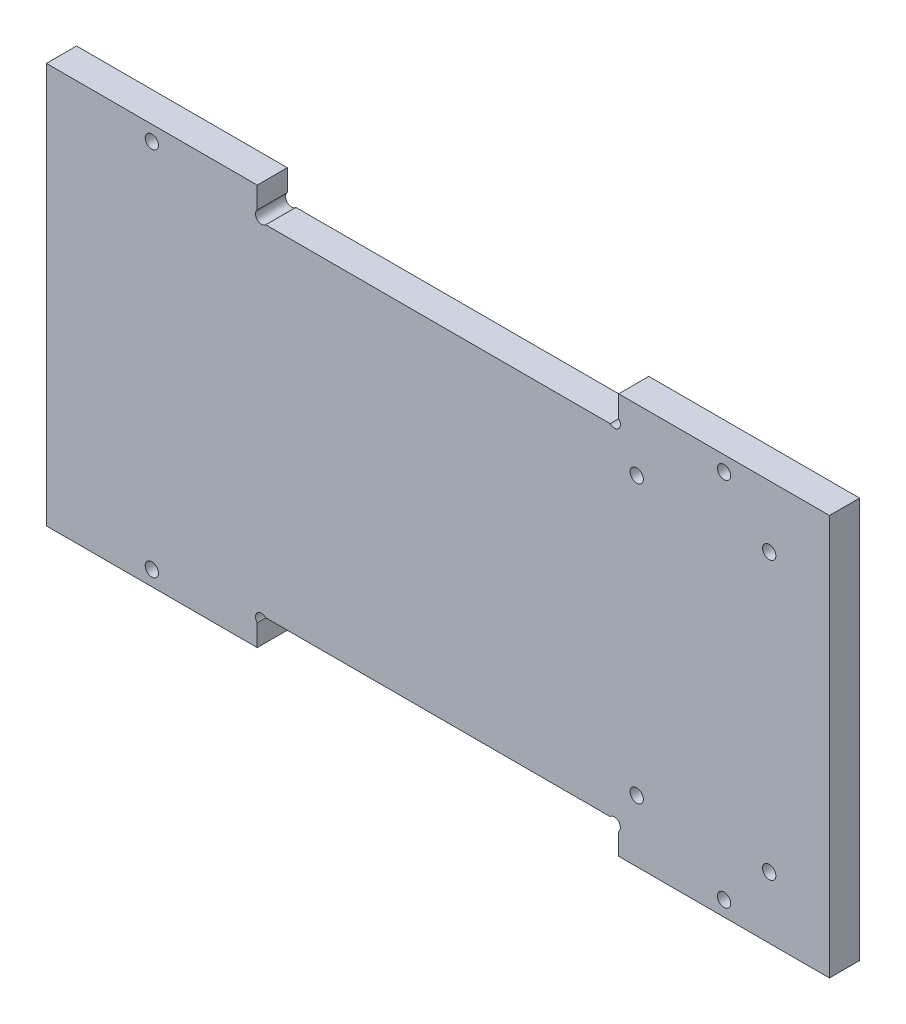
ISO-10303-21;
HEADER;
FILE_DESCRIPTION(('STEP AP214'),'2;1');
FILE_NAME('part.step','',(''),(''),'','','');
FILE_SCHEMA(('AUTOMOTIVE_DESIGN { 1 0 10303 214 1 1 1 1 }'));
ENDSEC;
DATA;
#1=APPLICATION_CONTEXT('core data for automotive mechanical design processes');
#2=APPLICATION_PROTOCOL_DEFINITION('international standard','automotive_design',2000,#1);
#3=PRODUCT_CONTEXT('',#1,'mechanical');
#4=PRODUCT('Part','Part','',(#3));
#5=PRODUCT_RELATED_PRODUCT_CATEGORY('part','',(#4));
#6=PRODUCT_DEFINITION_FORMATION('','',#4);
#7=PRODUCT_DEFINITION_CONTEXT('part definition',#1,'design');
#8=PRODUCT_DEFINITION('design','',#6,#7);
#9=PRODUCT_DEFINITION_SHAPE('','',#8);
#10=(LENGTH_UNIT() NAMED_UNIT(*) SI_UNIT(.MILLI.,.METRE.));
#11=(NAMED_UNIT(*) PLANE_ANGLE_UNIT() SI_UNIT($,.RADIAN.));
#12=(NAMED_UNIT(*) SI_UNIT($,.STERADIAN.) SOLID_ANGLE_UNIT());
#13=UNCERTAINTY_MEASURE_WITH_UNIT(LENGTH_MEASURE(1.E-05),#10,'distance_accuracy_value','');
#14=(GEOMETRIC_REPRESENTATION_CONTEXT(3) GLOBAL_UNCERTAINTY_ASSIGNED_CONTEXT((#13)) GLOBAL_UNIT_ASSIGNED_CONTEXT((#10,
#11,#12)) REPRESENTATION_CONTEXT('',''));
#15=CARTESIAN_POINT('',(0.,0.,0.));
#16=DIRECTION('',(0.,0.,1.));
#17=DIRECTION('',(1.,0.,0.));
#18=AXIS2_PLACEMENT_3D('',#15,#16,#17);
#19=CARTESIAN_POINT('',(0.,66.5,5.));
#20=DIRECTION('',(0.,0.,-1.));
#21=DIRECTION('',(-1.,0.,0.));
#22=AXIS2_PLACEMENT_3D('',#19,#20,#21);
#23=PLANE('',#22);
#24=CARTESIAN_POINT('',(17.5,2.5,5.));
#25=DIRECTION('',(0.,0.,-1.));
#26=DIRECTION('',(-1.,0.,0.));
#27=AXIS2_PLACEMENT_3D('',#24,#25,#26);
#28=CIRCLE('',#27,1.10000000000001);
#29=CARTESIAN_POINT('',(16.4,2.5,5.));
#30=VERTEX_POINT('',#29);
#31=EDGE_CURVE('E356',#30,#30,#28,.T.);
#32=ORIENTED_EDGE('',*,*,#31,.T.);
#33=EDGE_LOOP('',(#32));
#34=FACE_BOUND('',#33,.T.);
#35=CARTESIAN_POINT('',(112.5,2.5,5.));
#36=DIRECTION('',(0.,0.,-1.));
#37=DIRECTION('',(-1.,0.,0.));
#38=AXIS2_PLACEMENT_3D('',#35,#36,#37);
#39=CIRCLE('',#38,1.10000000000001);
#40=CARTESIAN_POINT('',(111.4,2.5,5.));
#41=VERTEX_POINT('',#40);
#42=EDGE_CURVE('E173',#41,#41,#39,.F.);
#43=ORIENTED_EDGE('',*,*,#42,.F.);
#44=EDGE_LOOP('',(#43));
#45=FACE_BOUND('',#44,.T.);
#46=CARTESIAN_POINT('',(120.,56.25,5.));
#47=DIRECTION('',(0.,0.,1.));
#48=DIRECTION('',(1.,0.,0.));
#49=AXIS2_PLACEMENT_3D('',#46,#47,#48);
#50=CIRCLE('',#49,1.09999999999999);
#51=CARTESIAN_POINT('',(121.1,56.25,5.));
#52=VERTEX_POINT('',#51);
#53=EDGE_CURVE('E247',#52,#52,#50,.T.);
#54=ORIENTED_EDGE('',*,*,#53,.F.);
#55=EDGE_LOOP('',(#54));
#56=FACE_BOUND('',#55,.T.);
#57=CARTESIAN_POINT('',(120.,10.25,5.));
#58=DIRECTION('',(0.,0.,1.));
#59=DIRECTION('',(1.,0.,0.));
#60=AXIS2_PLACEMENT_3D('',#57,#58,#59);
#61=CIRCLE('',#60,1.09999999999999);
#62=CARTESIAN_POINT('',(121.1,10.25,5.));
#63=VERTEX_POINT('',#62);
#64=EDGE_CURVE('E241',#63,#63,#61,.T.);
#65=ORIENTED_EDGE('',*,*,#64,.F.);
#66=EDGE_LOOP('',(#65));
#67=FACE_BOUND('',#66,.T.);
#68=CARTESIAN_POINT('',(98.,10.25,5.));
#69=DIRECTION('',(0.,0.,1.));
#70=DIRECTION('',(1.,0.,0.));
#71=AXIS2_PLACEMENT_3D('',#68,#69,#70);
#72=CIRCLE('',#71,1.10000000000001);
#73=CARTESIAN_POINT('',(99.1,10.25,5.));
#74=VERTEX_POINT('',#73);
#75=EDGE_CURVE('E235',#74,#74,#72,.T.);
#76=ORIENTED_EDGE('',*,*,#75,.F.);
#77=EDGE_LOOP('',(#76));
#78=FACE_BOUND('',#77,.T.);
#79=CARTESIAN_POINT('',(98.,56.25,5.));
#80=DIRECTION('',(0.,0.,1.));
#81=DIRECTION('',(1.,0.,0.));
#82=AXIS2_PLACEMENT_3D('',#79,#80,#81);
#83=CIRCLE('',#82,1.10000000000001);
#84=CARTESIAN_POINT('',(99.1,56.25,5.));
#85=VERTEX_POINT('',#84);
#86=EDGE_CURVE('E229',#85,#85,#83,.T.);
#87=ORIENTED_EDGE('',*,*,#86,.F.);
#88=EDGE_LOOP('',(#87));
#89=FACE_BOUND('',#88,.T.);
#90=CARTESIAN_POINT('',(35.7071067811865,62.2071067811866,5.));
#91=DIRECTION('',(0.,0.,-1.));
#92=DIRECTION('',(-1.,0.,0.));
#93=AXIS2_PLACEMENT_3D('',#90,#91,#92);
#94=CIRCLE('',#93,0.999999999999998);
#95=CARTESIAN_POINT('',(36.4142135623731,61.5,5.));
#96=VERTEX_POINT('',#95);
#97=CARTESIAN_POINT('',(35.,62.9142135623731,5.));
#98=VERTEX_POINT('',#97);
#99=EDGE_CURVE('E164',#96,#98,#94,.T.);
#100=ORIENTED_EDGE('',*,*,#99,.T.);
#101=DIRECTION('',(0.,1.,0.));
#102=VECTOR('',#101,1.);
#103=CARTESIAN_POINT('',(35.,66.5,5.));
#104=LINE('',#103,#102);
#105=CARTESIAN_POINT('',(35.,66.5,5.));
#106=VERTEX_POINT('',#105);
#107=EDGE_CURVE('E171',#98,#106,#104,.T.);
#108=ORIENTED_EDGE('',*,*,#107,.T.);
#109=DIRECTION('',(-1.,0.,0.));
#110=VECTOR('',#109,1.);
#111=CARTESIAN_POINT('',(0.,66.5,5.));
#112=LINE('',#111,#110);
#113=CARTESIAN_POINT('',(0.,66.5,5.));
#114=VERTEX_POINT('',#113);
#115=EDGE_CURVE('E263',#106,#114,#112,.T.);
#116=ORIENTED_EDGE('',*,*,#115,.T.);
#117=DIRECTION('',(0.,-1.,0.));
#118=VECTOR('',#117,1.);
#119=CARTESIAN_POINT('',(0.,0.,5.));
#120=LINE('',#119,#118);
#121=CARTESIAN_POINT('',(0.,0.,5.));
#122=VERTEX_POINT('',#121);
#123=EDGE_CURVE('E253',#114,#122,#120,.T.);
#124=ORIENTED_EDGE('',*,*,#123,.T.);
#125=DIRECTION('',(1.,0.,0.));
#126=VECTOR('',#125,1.);
#127=CARTESIAN_POINT('',(0.,0.,5.));
#128=LINE('',#127,#126);
#129=CARTESIAN_POINT('',(35.,0.,5.));
#130=VERTEX_POINT('',#129);
#131=EDGE_CURVE('E258',#122,#130,#128,.T.);
#132=ORIENTED_EDGE('',*,*,#131,.T.);
#133=DIRECTION('',(0.,-1.,0.));
#134=VECTOR('',#133,1.);
#135=CARTESIAN_POINT('',(35.,0.,5.));
#136=LINE('',#135,#134);
#137=CARTESIAN_POINT('',(35.,3.58578643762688,5.));
#138=VERTEX_POINT('',#137);
#139=EDGE_CURVE('E211',#138,#130,#136,.T.);
#140=ORIENTED_EDGE('',*,*,#139,.F.);
#141=CARTESIAN_POINT('',(35.7071067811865,4.29289321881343,5.));
#142=DIRECTION('',(0.,0.,-1.));
#143=DIRECTION('',(-1.,0.,0.));
#144=AXIS2_PLACEMENT_3D('',#141,#142,#143);
#145=CIRCLE('',#144,0.999999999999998);
#146=CARTESIAN_POINT('',(36.4142135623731,4.99999999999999,5.));
#147=VERTEX_POINT('',#146);
#148=EDGE_CURVE('E201',#147,#138,#145,.F.);
#149=ORIENTED_EDGE('',*,*,#148,.F.);
#150=DIRECTION('',(-1.,0.,0.));
#151=VECTOR('',#150,1.);
#152=CARTESIAN_POINT('',(35.,4.99999999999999,5.));
#153=LINE('',#152,#151);
#154=CARTESIAN_POINT('',(93.5857864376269,4.99999999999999,5.));
#155=VERTEX_POINT('',#154);
#156=EDGE_CURVE('E223',#155,#147,#153,.T.);
#157=ORIENTED_EDGE('',*,*,#156,.F.);
#158=CARTESIAN_POINT('',(94.2928932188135,4.29289321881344,5.));
#159=DIRECTION('',(0.,0.,-1.));
#160=DIRECTION('',(-1.,0.,0.));
#161=AXIS2_PLACEMENT_3D('',#158,#159,#160);
#162=CIRCLE('',#161,0.999999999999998);
#163=CARTESIAN_POINT('',(95.,3.5857864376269,5.));
#164=VERTEX_POINT('',#163);
#165=EDGE_CURVE('E60',#164,#155,#162,.F.);
#166=ORIENTED_EDGE('',*,*,#165,.F.);
#167=DIRECTION('',(0.,1.,0.));
#168=VECTOR('',#167,1.);
#169=CARTESIAN_POINT('',(95.,0.,5.));
#170=LINE('',#169,#168);
#171=CARTESIAN_POINT('',(95.,0.,5.));
#172=VERTEX_POINT('',#171);
#173=EDGE_CURVE('E208',#172,#164,#170,.T.);
#174=ORIENTED_EDGE('',*,*,#173,.F.);
#175=CARTESIAN_POINT('',(130.,0.,5.));
#176=VERTEX_POINT('',#175);
#177=EDGE_CURVE('E256',#172,#176,#128,.T.);
#178=ORIENTED_EDGE('',*,*,#177,.T.);
#179=DIRECTION('',(0.,1.,0.));
#180=VECTOR('',#179,1.);
#181=CARTESIAN_POINT('',(130.,0.,5.));
#182=LINE('',#181,#180);
#183=CARTESIAN_POINT('',(130.,66.5,5.));
#184=VERTEX_POINT('',#183);
#185=EDGE_CURVE('E261',#176,#184,#182,.T.);
#186=ORIENTED_EDGE('',*,*,#185,.T.);
#187=CARTESIAN_POINT('',(95.,66.5,5.));
#188=VERTEX_POINT('',#187);
#189=EDGE_CURVE('E264',#184,#188,#112,.T.);
#190=ORIENTED_EDGE('',*,*,#189,.T.);
#191=DIRECTION('',(0.,-1.,0.));
#192=VECTOR('',#191,1.);
#193=CARTESIAN_POINT('',(95.,66.5,5.));
#194=LINE('',#193,#192);
#195=CARTESIAN_POINT('',(95.,62.9142135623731,5.));
#196=VERTEX_POINT('',#195);
#197=EDGE_CURVE('E300',#188,#196,#194,.T.);
#198=ORIENTED_EDGE('',*,*,#197,.T.);
#199=CARTESIAN_POINT('',(94.2928932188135,62.2071067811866,5.));
#200=DIRECTION('',(0.,0.,-1.));
#201=DIRECTION('',(-1.,0.,0.));
#202=AXIS2_PLACEMENT_3D('',#199,#200,#201);
#203=CIRCLE('',#202,0.999999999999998);
#204=CARTESIAN_POINT('',(93.5857864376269,61.5,5.));
#205=VERTEX_POINT('',#204);
#206=EDGE_CURVE('E339',#196,#205,#203,.T.);
#207=ORIENTED_EDGE('',*,*,#206,.T.);
#208=DIRECTION('',(-1.,0.,0.));
#209=VECTOR('',#208,1.);
#210=CARTESIAN_POINT('',(35.,61.5,5.));
#211=LINE('',#210,#209);
#212=EDGE_CURVE('E183',#205,#96,#211,.T.);
#213=ORIENTED_EDGE('',*,*,#212,.T.);
#214=EDGE_LOOP('',(#100,#108,#116,#124,#132,#140,#149,#157,#166,#174,#178,#186,#190,#198,#207,#213));
#215=FACE_BOUND('',#214,.T.);
#216=CARTESIAN_POINT('',(17.5,64.,5.));
#217=DIRECTION('',(0.,0.,-1.));
#218=DIRECTION('',(-1.,0.,0.));
#219=AXIS2_PLACEMENT_3D('',#216,#217,#218);
#220=CIRCLE('',#219,1.10000000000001);
#221=CARTESIAN_POINT('',(16.4,64.,5.));
#222=VERTEX_POINT('',#221);
#223=EDGE_CURVE('E359',#222,#222,#220,.F.);
#224=ORIENTED_EDGE('',*,*,#223,.F.);
#225=EDGE_LOOP('',(#224));
#226=FACE_BOUND('',#225,.T.);
#227=CARTESIAN_POINT('',(112.5,64.,5.));
#228=DIRECTION('',(0.,0.,-1.));
#229=DIRECTION('',(-1.,0.,0.));
#230=AXIS2_PLACEMENT_3D('',#227,#228,#229);
#231=CIRCLE('',#230,1.10000000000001);
#232=CARTESIAN_POINT('',(111.4,64.,5.));
#233=VERTEX_POINT('',#232);
#234=EDGE_CURVE('E368',#233,#233,#231,.T.);
#235=ORIENTED_EDGE('',*,*,#234,.T.);
#236=EDGE_LOOP('',(#235));
#237=FACE_BOUND('',#236,.T.);
#238=ADVANCED_FACE('F37',(#34,#45,#56,#67,#78,#89,#215,#226,#237),#23,.F.);
#239=CARTESIAN_POINT('',(0.,66.5,0.));
#240=DIRECTION('',(0.,0.,-1.));
#241=DIRECTION('',(-1.,0.,0.));
#242=AXIS2_PLACEMENT_3D('',#239,#240,#241);
#243=PLANE('',#242);
#244=CARTESIAN_POINT('',(17.5,2.5,0.));
#245=DIRECTION('',(0.,0.,1.));
#246=DIRECTION('',(1.,0.,0.));
#247=AXIS2_PLACEMENT_3D('',#244,#245,#246);
#248=CIRCLE('',#247,1.10000000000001);
#249=CARTESIAN_POINT('',(18.6,2.5,0.));
#250=VERTEX_POINT('',#249);
#251=EDGE_CURVE('E355',#250,#250,#248,.T.);
#252=ORIENTED_EDGE('',*,*,#251,.T.);
#253=EDGE_LOOP('',(#252));
#254=FACE_BOUND('',#253,.T.);
#255=CARTESIAN_POINT('',(112.5,2.5,0.));
#256=DIRECTION('',(0.,0.,-1.));
#257=DIRECTION('',(-1.,0.,0.));
#258=AXIS2_PLACEMENT_3D('',#255,#256,#257);
#259=CIRCLE('',#258,1.10000000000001);
#260=CARTESIAN_POINT('',(111.4,2.5,0.));
#261=VERTEX_POINT('',#260);
#262=EDGE_CURVE('E352',#261,#261,#259,.T.);
#263=ORIENTED_EDGE('',*,*,#262,.F.);
#264=EDGE_LOOP('',(#263));
#265=FACE_BOUND('',#264,.T.);
#266=CARTESIAN_POINT('',(120.,56.25,0.));
#267=DIRECTION('',(0.,0.,-1.));
#268=DIRECTION('',(-1.,0.,0.));
#269=AXIS2_PLACEMENT_3D('',#266,#267,#268);
#270=CIRCLE('',#269,1.09999999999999);
#271=CARTESIAN_POINT('',(118.9,56.25,0.));
#272=VERTEX_POINT('',#271);
#273=EDGE_CURVE('E244',#272,#272,#270,.F.);
#274=ORIENTED_EDGE('',*,*,#273,.T.);
#275=EDGE_LOOP('',(#274));
#276=FACE_BOUND('',#275,.T.);
#277=CARTESIAN_POINT('',(120.,10.25,0.));
#278=DIRECTION('',(0.,0.,-1.));
#279=DIRECTION('',(-1.,0.,0.));
#280=AXIS2_PLACEMENT_3D('',#277,#278,#279);
#281=CIRCLE('',#280,1.09999999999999);
#282=CARTESIAN_POINT('',(118.9,10.25,0.));
#283=VERTEX_POINT('',#282);
#284=EDGE_CURVE('E238',#283,#283,#281,.F.);
#285=ORIENTED_EDGE('',*,*,#284,.T.);
#286=EDGE_LOOP('',(#285));
#287=FACE_BOUND('',#286,.T.);
#288=CARTESIAN_POINT('',(98.,10.25,0.));
#289=DIRECTION('',(0.,0.,-1.));
#290=DIRECTION('',(-1.,0.,0.));
#291=AXIS2_PLACEMENT_3D('',#288,#289,#290);
#292=CIRCLE('',#291,1.10000000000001);
#293=CARTESIAN_POINT('',(96.9,10.25,0.));
#294=VERTEX_POINT('',#293);
#295=EDGE_CURVE('E232',#294,#294,#292,.F.);
#296=ORIENTED_EDGE('',*,*,#295,.T.);
#297=EDGE_LOOP('',(#296));
#298=FACE_BOUND('',#297,.T.);
#299=CARTESIAN_POINT('',(98.,56.25,0.));
#300=DIRECTION('',(0.,0.,-1.));
#301=DIRECTION('',(-1.,0.,0.));
#302=AXIS2_PLACEMENT_3D('',#299,#300,#301);
#303=CIRCLE('',#302,1.10000000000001);
#304=CARTESIAN_POINT('',(96.9,56.25,0.));
#305=VERTEX_POINT('',#304);
#306=EDGE_CURVE('E228',#305,#305,#303,.F.);
#307=ORIENTED_EDGE('',*,*,#306,.T.);
#308=EDGE_LOOP('',(#307));
#309=FACE_BOUND('',#308,.T.);
#310=DIRECTION('',(0.,-1.,0.));
#311=VECTOR('',#310,1.);
#312=CARTESIAN_POINT('',(35.,66.5,0.));
#313=LINE('',#312,#311);
#314=CARTESIAN_POINT('',(35.,66.5,0.));
#315=VERTEX_POINT('',#314);
#316=CARTESIAN_POINT('',(35.,62.9142135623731,0.));
#317=VERTEX_POINT('',#316);
#318=EDGE_CURVE('E169',#315,#317,#313,.T.);
#319=ORIENTED_EDGE('',*,*,#318,.T.);
#320=CARTESIAN_POINT('',(35.7071067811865,62.2071067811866,0.));
#321=DIRECTION('',(0.,0.,1.));
#322=DIRECTION('',(-1.,0.,0.));
#323=AXIS2_PLACEMENT_3D('',#320,#321,#322);
#324=CIRCLE('',#323,0.999999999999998);
#325=CARTESIAN_POINT('',(36.4142135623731,61.5,0.));
#326=VERTEX_POINT('',#325);
#327=EDGE_CURVE('E153',#317,#326,#324,.T.);
#328=ORIENTED_EDGE('',*,*,#327,.T.);
#329=DIRECTION('',(1.,0.,0.));
#330=VECTOR('',#329,1.);
#331=CARTESIAN_POINT('',(35.,61.5,0.));
#332=LINE('',#331,#330);
#333=CARTESIAN_POINT('',(93.5857864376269,61.5,0.));
#334=VERTEX_POINT('',#333);
#335=EDGE_CURVE('E181',#326,#334,#332,.T.);
#336=ORIENTED_EDGE('',*,*,#335,.T.);
#337=CARTESIAN_POINT('',(94.2928932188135,62.2071067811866,0.));
#338=DIRECTION('',(0.,0.,1.));
#339=DIRECTION('',(-1.,0.,0.));
#340=AXIS2_PLACEMENT_3D('',#337,#338,#339);
#341=CIRCLE('',#340,0.999999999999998);
#342=CARTESIAN_POINT('',(95.,62.9142135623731,0.));
#343=VERTEX_POINT('',#342);
#344=EDGE_CURVE('E334',#334,#343,#341,.T.);
#345=ORIENTED_EDGE('',*,*,#344,.T.);
#346=DIRECTION('',(0.,1.,0.));
#347=VECTOR('',#346,1.);
#348=CARTESIAN_POINT('',(95.,66.5,0.));
#349=LINE('',#348,#347);
#350=CARTESIAN_POINT('',(95.,66.5,0.));
#351=VERTEX_POINT('',#350);
#352=EDGE_CURVE('E52',#343,#351,#349,.T.);
#353=ORIENTED_EDGE('',*,*,#352,.T.);
#354=DIRECTION('',(-1.,0.,0.));
#355=VECTOR('',#354,1.);
#356=CARTESIAN_POINT('',(0.,66.5,0.));
#357=LINE('',#356,#355);
#358=CARTESIAN_POINT('',(130.,66.5,0.));
#359=VERTEX_POINT('',#358);
#360=EDGE_CURVE('E257',#359,#351,#357,.T.);
#361=ORIENTED_EDGE('',*,*,#360,.F.);
#362=DIRECTION('',(0.,1.,0.));
#363=VECTOR('',#362,1.);
#364=CARTESIAN_POINT('',(130.,0.,0.));
#365=LINE('',#364,#363);
#366=CARTESIAN_POINT('',(130.,0.,0.));
#367=VERTEX_POINT('',#366);
#368=EDGE_CURVE('E274',#367,#359,#365,.T.);
#369=ORIENTED_EDGE('',*,*,#368,.F.);
#370=DIRECTION('',(1.,0.,0.));
#371=VECTOR('',#370,1.);
#372=CARTESIAN_POINT('',(0.,0.,0.));
#373=LINE('',#372,#371);
#374=CARTESIAN_POINT('',(95.,0.,0.));
#375=VERTEX_POINT('',#374);
#376=EDGE_CURVE('E270',#375,#367,#373,.T.);
#377=ORIENTED_EDGE('',*,*,#376,.F.);
#378=DIRECTION('',(0.,-1.,0.));
#379=VECTOR('',#378,1.);
#380=CARTESIAN_POINT('',(95.,0.,0.));
#381=LINE('',#380,#379);
#382=CARTESIAN_POINT('',(95.,3.5857864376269,0.));
#383=VERTEX_POINT('',#382);
#384=EDGE_CURVE('E218',#383,#375,#381,.T.);
#385=ORIENTED_EDGE('',*,*,#384,.F.);
#386=CARTESIAN_POINT('',(94.2928932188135,4.29289321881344,0.));
#387=DIRECTION('',(0.,0.,-1.));
#388=DIRECTION('',(-1.,0.,0.));
#389=AXIS2_PLACEMENT_3D('',#386,#387,#388);
#390=CIRCLE('',#389,0.999999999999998);
#391=CARTESIAN_POINT('',(93.5857864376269,4.99999999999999,0.));
#392=VERTEX_POINT('',#391);
#393=EDGE_CURVE('E205',#392,#383,#390,.T.);
#394=ORIENTED_EDGE('',*,*,#393,.F.);
#395=DIRECTION('',(1.,0.,0.));
#396=VECTOR('',#395,1.);
#397=CARTESIAN_POINT('',(35.,4.99999999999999,0.));
#398=LINE('',#397,#396);
#399=CARTESIAN_POINT('',(36.4142135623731,4.99999999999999,0.));
#400=VERTEX_POINT('',#399);
#401=EDGE_CURVE('E216',#400,#392,#398,.T.);
#402=ORIENTED_EDGE('',*,*,#401,.F.);
#403=CARTESIAN_POINT('',(35.7071067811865,4.29289321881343,0.));
#404=DIRECTION('',(0.,0.,-1.));
#405=DIRECTION('',(-1.,0.,0.));
#406=AXIS2_PLACEMENT_3D('',#403,#404,#405);
#407=CIRCLE('',#406,0.999999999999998);
#408=CARTESIAN_POINT('',(35.,3.58578643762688,0.));
#409=VERTEX_POINT('',#408);
#410=EDGE_CURVE('E199',#409,#400,#407,.T.);
#411=ORIENTED_EDGE('',*,*,#410,.F.);
#412=DIRECTION('',(0.,1.,0.));
#413=VECTOR('',#412,1.);
#414=CARTESIAN_POINT('',(35.,0.,0.));
#415=LINE('',#414,#413);
#416=CARTESIAN_POINT('',(35.,0.,0.));
#417=VERTEX_POINT('',#416);
#418=EDGE_CURVE('E213',#417,#409,#415,.T.);
#419=ORIENTED_EDGE('',*,*,#418,.F.);
#420=CARTESIAN_POINT('',(0.,0.,0.));
#421=VERTEX_POINT('',#420);
#422=EDGE_CURVE('E271',#421,#417,#373,.T.);
#423=ORIENTED_EDGE('',*,*,#422,.F.);
#424=DIRECTION('',(0.,-1.,0.));
#425=VECTOR('',#424,1.);
#426=CARTESIAN_POINT('',(0.,0.,0.));
#427=LINE('',#426,#425);
#428=CARTESIAN_POINT('',(0.,66.5,0.));
#429=VERTEX_POINT('',#428);
#430=EDGE_CURVE('E250',#429,#421,#427,.T.);
#431=ORIENTED_EDGE('',*,*,#430,.F.);
#432=EDGE_CURVE('E179',#315,#429,#357,.T.);
#433=ORIENTED_EDGE('',*,*,#432,.F.);
#434=EDGE_LOOP('',(#319,#328,#336,#345,#353,#361,#369,#377,#385,#394,#402,#411,#419,#423,#431,#433));
#435=FACE_BOUND('',#434,.T.);
#436=CARTESIAN_POINT('',(17.5,64.,0.));
#437=DIRECTION('',(0.,0.,-1.));
#438=DIRECTION('',(1.,0.,0.));
#439=AXIS2_PLACEMENT_3D('',#436,#437,#438);
#440=CIRCLE('',#439,1.10000000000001);
#441=CARTESIAN_POINT('',(18.6,64.,0.));
#442=VERTEX_POINT('',#441);
#443=EDGE_CURVE('E364',#442,#442,#440,.T.);
#444=ORIENTED_EDGE('',*,*,#443,.F.);
#445=EDGE_LOOP('',(#444));
#446=FACE_BOUND('',#445,.T.);
#447=CARTESIAN_POINT('',(112.5,64.,0.));
#448=DIRECTION('',(0.,0.,1.));
#449=DIRECTION('',(-1.,0.,0.));
#450=AXIS2_PLACEMENT_3D('',#447,#448,#449);
#451=CIRCLE('',#450,1.10000000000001);
#452=CARTESIAN_POINT('',(111.4,64.,0.));
#453=VERTEX_POINT('',#452);
#454=EDGE_CURVE('E367',#453,#453,#451,.T.);
#455=ORIENTED_EDGE('',*,*,#454,.T.);
#456=EDGE_LOOP('',(#455));
#457=FACE_BOUND('',#456,.T.);
#458=ADVANCED_FACE('F176',(#254,#265,#276,#287,#298,#309,#435,#446,#457),#243,.T.);
#459=CARTESIAN_POINT('',(35.,66.5,5.001));
#460=DIRECTION('',(1.,0.,0.));
#461=DIRECTION('',(0.,0.,-1.));
#462=AXIS2_PLACEMENT_3D('',#459,#460,#461);
#463=PLANE('',#462);
#464=ORIENTED_EDGE('',*,*,#107,.F.);
#465=DIRECTION('',(0.,0.,-1.));
#466=VECTOR('',#465,1.);
#467=CARTESIAN_POINT('',(35.,62.9142135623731,5.001));
#468=LINE('',#467,#466);
#469=EDGE_CURVE('E157',#317,#98,#468,.F.);
#470=ORIENTED_EDGE('',*,*,#469,.F.);
#471=ORIENTED_EDGE('',*,*,#318,.F.);
#472=DIRECTION('',(0.,0.,-1.));
#473=VECTOR('',#472,1.);
#474=CARTESIAN_POINT('',(35.,66.5,5.001));
#475=LINE('',#474,#473);
#476=EDGE_CURVE('E188',#106,#315,#475,.T.);
#477=ORIENTED_EDGE('',*,*,#476,.F.);
#478=EDGE_LOOP('',(#464,#470,#471,#477));
#479=FACE_BOUND('',#478,.T.);
#480=ADVANCED_FACE('F167',(#479),#463,.T.);
#481=CARTESIAN_POINT('',(35.,61.5,5.001));
#482=DIRECTION('',(0.,1.,0.));
#483=DIRECTION('',(0.,0.,1.));
#484=AXIS2_PLACEMENT_3D('',#481,#482,#483);
#485=PLANE('',#484);
#486=ORIENTED_EDGE('',*,*,#212,.F.);
#487=DIRECTION('',(0.,0.,-1.));
#488=VECTOR('',#487,1.);
#489=CARTESIAN_POINT('',(93.5857864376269,61.5,5.001));
#490=LINE('',#489,#488);
#491=EDGE_CURVE('E172',#334,#205,#490,.F.);
#492=ORIENTED_EDGE('',*,*,#491,.F.);
#493=ORIENTED_EDGE('',*,*,#335,.F.);
#494=DIRECTION('',(0.,0.,-1.));
#495=VECTOR('',#494,1.);
#496=CARTESIAN_POINT('',(36.4142135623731,61.5,5.001));
#497=LINE('',#496,#495);
#498=EDGE_CURVE('E160',#96,#326,#497,.T.);
#499=ORIENTED_EDGE('',*,*,#498,.F.);
#500=EDGE_LOOP('',(#486,#492,#493,#499));
#501=FACE_BOUND('',#500,.T.);
#502=ADVANCED_FACE('F348',(#501),#485,.T.);
#503=CARTESIAN_POINT('',(95.,66.5,5.001));
#504=DIRECTION('',(-1.,0.,0.));
#505=DIRECTION('',(0.,0.,1.));
#506=AXIS2_PLACEMENT_3D('',#503,#504,#505);
#507=PLANE('',#506);
#508=ORIENTED_EDGE('',*,*,#352,.F.);
#509=DIRECTION('',(0.,0.,-1.));
#510=VECTOR('',#509,1.);
#511=CARTESIAN_POINT('',(95.,62.9142135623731,5.001));
#512=LINE('',#511,#510);
#513=EDGE_CURVE('E332',#196,#343,#512,.T.);
#514=ORIENTED_EDGE('',*,*,#513,.F.);
#515=ORIENTED_EDGE('',*,*,#197,.F.);
#516=DIRECTION('',(0.,0.,-1.));
#517=VECTOR('',#516,1.);
#518=CARTESIAN_POINT('',(95.,66.5,5.001));
#519=LINE('',#518,#517);
#520=EDGE_CURVE('E189',#188,#351,#519,.T.);
#521=ORIENTED_EDGE('',*,*,#520,.T.);
#522=EDGE_LOOP('',(#508,#514,#515,#521));
#523=FACE_BOUND('',#522,.T.);
#524=ADVANCED_FACE('F397',(#523),#507,.T.);
#525=CARTESIAN_POINT('',(0.,66.5,5.));
#526=DIRECTION('',(0.,-1.,0.));
#527=DIRECTION('',(0.,0.,-1.));
#528=AXIS2_PLACEMENT_3D('',#525,#526,#527);
#529=PLANE('',#528);
#530=ORIENTED_EDGE('',*,*,#476,.T.);
#531=ORIENTED_EDGE('',*,*,#432,.T.);
#532=DIRECTION('',(0.,0.,-1.));
#533=VECTOR('',#532,1.);
#534=CARTESIAN_POINT('',(0.,66.5,5.));
#535=LINE('',#534,#533);
#536=EDGE_CURVE('E267',#114,#429,#535,.T.);
#537=ORIENTED_EDGE('',*,*,#536,.F.);
#538=ORIENTED_EDGE('',*,*,#115,.F.);
#539=EDGE_LOOP('',(#530,#531,#537,#538));
#540=FACE_BOUND('',#539,.T.);
#541=ADVANCED_FACE('F330',(#540),#529,.F.);
#542=ORIENTED_EDGE('',*,*,#520,.F.);
#543=ORIENTED_EDGE('',*,*,#189,.F.);
#544=DIRECTION('',(0.,0.,-1.));
#545=VECTOR('',#544,1.);
#546=CARTESIAN_POINT('',(130.,66.5,5.));
#547=LINE('',#546,#545);
#548=EDGE_CURVE('E280',#184,#359,#547,.T.);
#549=ORIENTED_EDGE('',*,*,#548,.T.);
#550=ORIENTED_EDGE('',*,*,#360,.T.);
#551=EDGE_LOOP('',(#542,#543,#549,#550));
#552=FACE_BOUND('',#551,.T.);
#553=ADVANCED_FACE('F295',(#552),#529,.F.);
#554=CARTESIAN_POINT('',(0.,0.,5.));
#555=DIRECTION('',(0.,1.,0.));
#556=DIRECTION('',(0.,0.,1.));
#557=AXIS2_PLACEMENT_3D('',#554,#555,#556);
#558=PLANE('',#557);
#559=ORIENTED_EDGE('',*,*,#422,.T.);
#560=DIRECTION('',(0.,0.,-1.));
#561=VECTOR('',#560,1.);
#562=CARTESIAN_POINT('',(35.,0.,5.001));
#563=LINE('',#562,#561);
#564=EDGE_CURVE('E221',#130,#417,#563,.T.);
#565=ORIENTED_EDGE('',*,*,#564,.F.);
#566=ORIENTED_EDGE('',*,*,#131,.F.);
#567=DIRECTION('',(0.,0.,-1.));
#568=VECTOR('',#567,1.);
#569=CARTESIAN_POINT('',(0.,0.,5.));
#570=LINE('',#569,#568);
#571=EDGE_CURVE('E11',#122,#421,#570,.T.);
#572=ORIENTED_EDGE('',*,*,#571,.T.);
#573=EDGE_LOOP('',(#559,#565,#566,#572));
#574=FACE_BOUND('',#573,.T.);
#575=ADVANCED_FACE('F323',(#574),#558,.F.);
#576=CARTESIAN_POINT('',(0.,0.,5.));
#577=DIRECTION('',(1.,0.,0.));
#578=DIRECTION('',(0.,0.,-1.));
#579=AXIS2_PLACEMENT_3D('',#576,#577,#578);
#580=PLANE('',#579);
#581=ORIENTED_EDGE('',*,*,#430,.T.);
#582=ORIENTED_EDGE('',*,*,#571,.F.);
#583=ORIENTED_EDGE('',*,*,#123,.F.);
#584=ORIENTED_EDGE('',*,*,#536,.T.);
#585=EDGE_LOOP('',(#581,#582,#583,#584));
#586=FACE_BOUND('',#585,.T.);
#587=ADVANCED_FACE('F39',(#586),#580,.F.);
#588=ORIENTED_EDGE('',*,*,#177,.F.);
#589=DIRECTION('',(0.,0.,-1.));
#590=VECTOR('',#589,1.);
#591=CARTESIAN_POINT('',(95.,0.,5.001));
#592=LINE('',#591,#590);
#593=EDGE_CURVE('E220',#172,#375,#592,.T.);
#594=ORIENTED_EDGE('',*,*,#593,.T.);
#595=ORIENTED_EDGE('',*,*,#376,.T.);
#596=DIRECTION('',(0.,0.,-1.));
#597=VECTOR('',#596,1.);
#598=CARTESIAN_POINT('',(130.,0.,5.));
#599=LINE('',#598,#597);
#600=EDGE_CURVE('E45',#176,#367,#599,.T.);
#601=ORIENTED_EDGE('',*,*,#600,.F.);
#602=EDGE_LOOP('',(#588,#594,#595,#601));
#603=FACE_BOUND('',#602,.T.);
#604=ADVANCED_FACE('F302',(#603),#558,.F.);
#605=CARTESIAN_POINT('',(130.,0.,5.));
#606=DIRECTION('',(-1.,0.,0.));
#607=DIRECTION('',(0.,0.,1.));
#608=AXIS2_PLACEMENT_3D('',#605,#606,#607);
#609=PLANE('',#608);
#610=ORIENTED_EDGE('',*,*,#368,.T.);
#611=ORIENTED_EDGE('',*,*,#548,.F.);
#612=ORIENTED_EDGE('',*,*,#185,.F.);
#613=ORIENTED_EDGE('',*,*,#600,.T.);
#614=EDGE_LOOP('',(#610,#611,#612,#613));
#615=FACE_BOUND('',#614,.T.);
#616=ADVANCED_FACE('F287',(#615),#609,.F.);
#617=CARTESIAN_POINT('',(120.,56.25,-0.00100000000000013));
#618=DIRECTION('',(0.,0.,1.));
#619=DIRECTION('',(1.,0.,0.));
#620=AXIS2_PLACEMENT_3D('',#617,#618,#619);
#621=CYLINDRICAL_SURFACE('',#620,1.09999999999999);
#622=ORIENTED_EDGE('',*,*,#273,.F.);
#623=EDGE_LOOP('',(#622));
#624=FACE_BOUND('',#623,.T.);
#625=ORIENTED_EDGE('',*,*,#53,.T.);
#626=EDGE_LOOP('',(#625));
#627=FACE_BOUND('',#626,.T.);
#628=ADVANCED_FACE('F392',(#624,#627),#621,.F.);
#629=CARTESIAN_POINT('',(120.,10.25,-0.00100000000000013));
#630=DIRECTION('',(0.,0.,1.));
#631=DIRECTION('',(1.,0.,0.));
#632=AXIS2_PLACEMENT_3D('',#629,#630,#631);
#633=CYLINDRICAL_SURFACE('',#632,1.09999999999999);
#634=ORIENTED_EDGE('',*,*,#284,.F.);
#635=EDGE_LOOP('',(#634));
#636=FACE_BOUND('',#635,.T.);
#637=ORIENTED_EDGE('',*,*,#64,.T.);
#638=EDGE_LOOP('',(#637));
#639=FACE_BOUND('',#638,.T.);
#640=ADVANCED_FACE('F528',(#636,#639),#633,.F.);
#641=CARTESIAN_POINT('',(98.,10.25,-0.00100000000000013));
#642=DIRECTION('',(0.,0.,1.));
#643=DIRECTION('',(1.,0.,0.));
#644=AXIS2_PLACEMENT_3D('',#641,#642,#643);
#645=CYLINDRICAL_SURFACE('',#644,1.10000000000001);
#646=ORIENTED_EDGE('',*,*,#295,.F.);
#647=EDGE_LOOP('',(#646));
#648=FACE_BOUND('',#647,.T.);
#649=ORIENTED_EDGE('',*,*,#75,.T.);
#650=EDGE_LOOP('',(#649));
#651=FACE_BOUND('',#650,.T.);
#652=ADVANCED_FACE('F520',(#648,#651),#645,.F.);
#653=CARTESIAN_POINT('',(98.,56.25,-0.00100000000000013));
#654=DIRECTION('',(0.,0.,1.));
#655=DIRECTION('',(1.,0.,0.));
#656=AXIS2_PLACEMENT_3D('',#653,#654,#655);
#657=CYLINDRICAL_SURFACE('',#656,1.10000000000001);
#658=ORIENTED_EDGE('',*,*,#306,.F.);
#659=EDGE_LOOP('',(#658));
#660=FACE_BOUND('',#659,.T.);
#661=ORIENTED_EDGE('',*,*,#86,.T.);
#662=EDGE_LOOP('',(#661));
#663=FACE_BOUND('',#662,.T.);
#664=ADVANCED_FACE('F513',(#660,#663),#657,.F.);
#665=CARTESIAN_POINT('',(35.,0.,5.001));
#666=DIRECTION('',(-1.,0.,0.));
#667=DIRECTION('',(0.,0.,1.));
#668=AXIS2_PLACEMENT_3D('',#665,#666,#667);
#669=PLANE('',#668);
#670=ORIENTED_EDGE('',*,*,#418,.T.);
#671=DIRECTION('',(0.,0.,-1.));
#672=VECTOR('',#671,1.);
#673=CARTESIAN_POINT('',(35.,3.58578643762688,5.001));
#674=LINE('',#673,#672);
#675=EDGE_CURVE('E191',#138,#409,#674,.T.);
#676=ORIENTED_EDGE('',*,*,#675,.F.);
#677=ORIENTED_EDGE('',*,*,#139,.T.);
#678=ORIENTED_EDGE('',*,*,#564,.T.);
#679=EDGE_LOOP('',(#670,#676,#677,#678));
#680=FACE_BOUND('',#679,.T.);
#681=ADVANCED_FACE('F319',(#680),#669,.F.);
#682=CARTESIAN_POINT('',(95.,0.,5.001));
#683=DIRECTION('',(1.,0.,0.));
#684=DIRECTION('',(0.,0.,-1.));
#685=AXIS2_PLACEMENT_3D('',#682,#683,#684);
#686=PLANE('',#685);
#687=ORIENTED_EDGE('',*,*,#173,.T.);
#688=DIRECTION('',(0.,0.,-1.));
#689=VECTOR('',#688,1.);
#690=CARTESIAN_POINT('',(95.,3.5857864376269,5.001));
#691=LINE('',#690,#689);
#692=EDGE_CURVE('E195',#383,#164,#691,.F.);
#693=ORIENTED_EDGE('',*,*,#692,.F.);
#694=ORIENTED_EDGE('',*,*,#384,.T.);
#695=ORIENTED_EDGE('',*,*,#593,.F.);
#696=EDGE_LOOP('',(#687,#693,#694,#695));
#697=FACE_BOUND('',#696,.T.);
#698=ADVANCED_FACE('F304',(#697),#686,.F.);
#699=CARTESIAN_POINT('',(35.,4.99999999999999,5.001));
#700=DIRECTION('',(0.,1.,0.));
#701=DIRECTION('',(0.,0.,1.));
#702=AXIS2_PLACEMENT_3D('',#699,#700,#701);
#703=PLANE('',#702);
#704=ORIENTED_EDGE('',*,*,#156,.T.);
#705=DIRECTION('',(0.,0.,-1.));
#706=VECTOR('',#705,1.);
#707=CARTESIAN_POINT('',(36.4142135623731,4.99999999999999,5.001));
#708=LINE('',#707,#706);
#709=EDGE_CURVE('E197',#400,#147,#708,.F.);
#710=ORIENTED_EDGE('',*,*,#709,.F.);
#711=ORIENTED_EDGE('',*,*,#401,.T.);
#712=DIRECTION('',(0.,0.,-1.));
#713=VECTOR('',#712,1.);
#714=CARTESIAN_POINT('',(93.5857864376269,4.99999999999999,5.001));
#715=LINE('',#714,#713);
#716=EDGE_CURVE('E203',#155,#392,#715,.T.);
#717=ORIENTED_EDGE('',*,*,#716,.F.);
#718=EDGE_LOOP('',(#704,#710,#711,#717));
#719=FACE_BOUND('',#718,.T.);
#720=ADVANCED_FACE('F311',(#719),#703,.F.);
#721=CARTESIAN_POINT('',(94.2928932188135,4.29289321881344,5.001));
#722=DIRECTION('',(0.,0.,-1.));
#723=DIRECTION('',(-1.,0.,0.));
#724=AXIS2_PLACEMENT_3D('',#721,#722,#723);
#725=CYLINDRICAL_SURFACE('',#724,0.999999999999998);
#726=ORIENTED_EDGE('',*,*,#393,.T.);
#727=ORIENTED_EDGE('',*,*,#692,.T.);
#728=ORIENTED_EDGE('',*,*,#165,.T.);
#729=ORIENTED_EDGE('',*,*,#716,.T.);
#730=EDGE_LOOP('',(#726,#727,#728,#729));
#731=FACE_BOUND('',#730,.T.);
#732=ADVANCED_FACE('F308',(#731),#725,.F.);
#733=CARTESIAN_POINT('',(35.7071067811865,4.29289321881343,5.001));
#734=DIRECTION('',(0.,0.,-1.));
#735=DIRECTION('',(-1.,0.,0.));
#736=AXIS2_PLACEMENT_3D('',#733,#734,#735);
#737=CYLINDRICAL_SURFACE('',#736,0.999999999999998);
#738=ORIENTED_EDGE('',*,*,#148,.T.);
#739=ORIENTED_EDGE('',*,*,#675,.T.);
#740=ORIENTED_EDGE('',*,*,#410,.T.);
#741=ORIENTED_EDGE('',*,*,#709,.T.);
#742=EDGE_LOOP('',(#738,#739,#740,#741));
#743=FACE_BOUND('',#742,.T.);
#744=ADVANCED_FACE('F317',(#743),#737,.F.);
#745=CARTESIAN_POINT('',(94.2928932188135,62.2071067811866,5.001));
#746=DIRECTION('',(0.,0.,-1.));
#747=DIRECTION('',(-1.,0.,0.));
#748=AXIS2_PLACEMENT_3D('',#745,#746,#747);
#749=CYLINDRICAL_SURFACE('',#748,0.999999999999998);
#750=ORIENTED_EDGE('',*,*,#513,.T.);
#751=ORIENTED_EDGE('',*,*,#344,.F.);
#752=ORIENTED_EDGE('',*,*,#491,.T.);
#753=ORIENTED_EDGE('',*,*,#206,.F.);
#754=EDGE_LOOP('',(#750,#751,#752,#753));
#755=FACE_BOUND('',#754,.T.);
#756=ADVANCED_FACE('F345',(#755),#749,.F.);
#757=CARTESIAN_POINT('',(35.7071067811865,62.2071067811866,5.001));
#758=DIRECTION('',(0.,0.,-1.));
#759=DIRECTION('',(-1.,0.,0.));
#760=AXIS2_PLACEMENT_3D('',#757,#758,#759);
#761=CYLINDRICAL_SURFACE('',#760,0.999999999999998);
#762=ORIENTED_EDGE('',*,*,#498,.T.);
#763=ORIENTED_EDGE('',*,*,#327,.F.);
#764=ORIENTED_EDGE('',*,*,#469,.T.);
#765=ORIENTED_EDGE('',*,*,#99,.F.);
#766=EDGE_LOOP('',(#762,#763,#764,#765));
#767=FACE_BOUND('',#766,.T.);
#768=ADVANCED_FACE('F155',(#767),#761,.F.);
#769=CARTESIAN_POINT('',(112.5,2.5,5.001));
#770=DIRECTION('',(0.,0.,-1.));
#771=DIRECTION('',(-1.,0.,0.));
#772=AXIS2_PLACEMENT_3D('',#769,#770,#771);
#773=CYLINDRICAL_SURFACE('',#772,1.10000000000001);
#774=ORIENTED_EDGE('',*,*,#262,.T.);
#775=EDGE_LOOP('',(#774));
#776=FACE_BOUND('',#775,.T.);
#777=ORIENTED_EDGE('',*,*,#42,.T.);
#778=EDGE_LOOP('',(#777));
#779=FACE_BOUND('',#778,.T.);
#780=ADVANCED_FACE('F465',(#776,#779),#773,.F.);
#781=CARTESIAN_POINT('',(17.5,2.5,5.001));
#782=DIRECTION('',(0.,0.,-1.));
#783=DIRECTION('',(-1.,0.,0.));
#784=AXIS2_PLACEMENT_3D('',#781,#782,#783);
#785=CYLINDRICAL_SURFACE('',#784,1.10000000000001);
#786=ORIENTED_EDGE('',*,*,#251,.F.);
#787=EDGE_LOOP('',(#786));
#788=FACE_BOUND('',#787,.T.);
#789=ORIENTED_EDGE('',*,*,#31,.F.);
#790=EDGE_LOOP('',(#789));
#791=FACE_BOUND('',#790,.T.);
#792=ADVANCED_FACE('F451',(#788,#791),#785,.F.);
#793=CARTESIAN_POINT('',(17.5,64.,5.001));
#794=DIRECTION('',(0.,0.,-1.));
#795=DIRECTION('',(-1.,0.,0.));
#796=AXIS2_PLACEMENT_3D('',#793,#794,#795);
#797=CYLINDRICAL_SURFACE('',#796,1.10000000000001);
#798=ORIENTED_EDGE('',*,*,#443,.T.);
#799=EDGE_LOOP('',(#798));
#800=FACE_BOUND('',#799,.T.);
#801=ORIENTED_EDGE('',*,*,#223,.T.);
#802=EDGE_LOOP('',(#801));
#803=FACE_BOUND('',#802,.T.);
#804=ADVANCED_FACE('F378',(#800,#803),#797,.F.);
#805=CARTESIAN_POINT('',(112.5,64.,5.001));
#806=DIRECTION('',(0.,0.,-1.));
#807=DIRECTION('',(-1.,0.,0.));
#808=AXIS2_PLACEMENT_3D('',#805,#806,#807);
#809=CYLINDRICAL_SURFACE('',#808,1.10000000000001);
#810=ORIENTED_EDGE('',*,*,#454,.F.);
#811=EDGE_LOOP('',(#810));
#812=FACE_BOUND('',#811,.T.);
#813=ORIENTED_EDGE('',*,*,#234,.F.);
#814=EDGE_LOOP('',(#813));
#815=FACE_BOUND('',#814,.T.);
#816=ADVANCED_FACE('F375',(#812,#815),#809,.F.);
#817=CLOSED_SHELL('',(#238,#458,#480,#502,#524,#541,#553,#575,#587,#604,#616,#628,#640,#652,
#664,#681,#698,#720,#732,#744,#756,#768,#780,#792,#804,#816));
#818=MANIFOLD_SOLID_BREP('B2',#817);
#819=ADVANCED_BREP_SHAPE_REPRESENTATION('',(#18,#818),#14);
#820=SHAPE_DEFINITION_REPRESENTATION(#9,#819);
ENDSEC;
END-ISO-10303-21;
